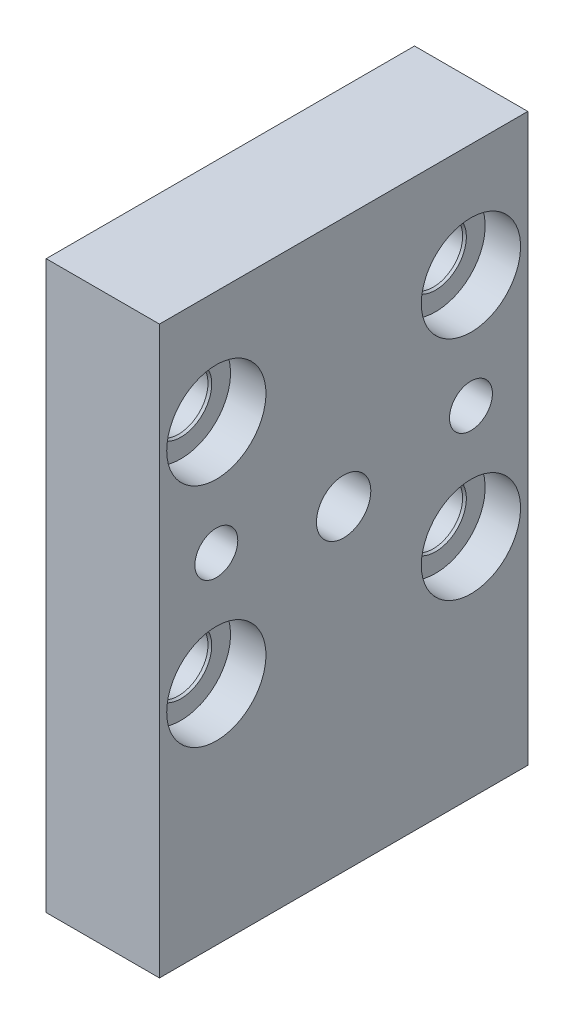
from build123d import *

# Parameters (mm, degrees)
SKETCH1_W          = 20.6502
SKETCH1_H          = 31.75
SKETCH1_R          = 1.20269
SKETCH1_R_2        = 1.524
EXTRUDE1_DEPTH     = 6.35
SKETCH6_R          = 2.7432
CUT_EXTRUDE1_DEPTH = 3.175
SKETCH7_R          = 2.7432
CUT_EXTRUDE2_DEPTH = 3.175
SKETCH8_R          = 2.7432
CUT_EXTRUDE3_DEPTH = 3.175
CUT_EXTRUDE4_DEPTH = 1.5875
CUT_EXTRUDE5_DEPTH = 1.5875
CUT_EXTRUDE6_DEPTH = 1.5875


with BuildPart() as part:
    # Sketch1 → Extrude1 (new body)
    with BuildSketch(Plane(origin=(0, 0, 0), x_dir=(0, 0, -1), z_dir=(1, 0, 0))):
        with Locations((0, 15.875)):
            Rectangle(SKETCH1_W, SKETCH1_H)
        with Locations((7.1374, 19.05)):
            Circle(SKETCH1_R, mode=Mode.SUBTRACT)
        with Locations((0, 17.7292)):
            Circle(SKETCH1_R_2, mode=Mode.SUBTRACT)
        with Locations((-7.1374, 19.05)):
            Circle(SKETCH1_R, mode=Mode.SUBTRACT)
    extrude(amount=EXTRUDE1_DEPTH)

    # Sketch2 → Cut-Revolve1 (revolve, cut)
    with BuildSketch(Plane.XY.offset(7.1374), mode=Mode.PRIVATE) as cut_revolve1_sk:
        Polygon((0, 25.4), (0, 27.051), (4.233333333, 27.051), (4.365315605, 27.1272), (4.365315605, 28.1813), (6.35, 28.1813), (6.35, 25.4), align=None)
    revolve(cut_revolve1_sk.sketch.rotate(Axis((6.35, 25.4, 7.1374), (-1, 0, 0)), 270), axis=Axis((6.35, 25.4, 7.1374), (-1, 0, 0)), mode=Mode.SUBTRACT)

    # Sketch3 → Cut-Revolve2 (revolve, cut)
    with BuildSketch(Plane.XY.offset(-7.1374), mode=Mode.PRIVATE) as cut_revolve2_sk:
        Polygon((0, 12.7), (0, 14.351), (4.233333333, 14.351), (4.365315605, 14.4272), (4.365315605, 15.4813), (6.35, 15.4813), (6.35, 12.7), align=None)
    revolve(cut_revolve2_sk.sketch.rotate(Axis((6.35, 12.7, -7.1374), (-1, 0, 0)), 270), axis=Axis((6.35, 12.7, -7.1374), (-1, 0, 0)), mode=Mode.SUBTRACT)

    # Sketch4 → Cut-Revolve3 (revolve, cut)
    with BuildSketch(Plane.XY.offset(7.1374), mode=Mode.PRIVATE) as cut_revolve3_sk:
        Polygon((0, 12.7), (0, 14.351), (4.233333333, 14.351), (4.365315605, 14.4272), (4.365315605, 15.4813), (6.35, 15.4813), (6.35, 12.7), align=None)
    revolve(cut_revolve3_sk.sketch.rotate(Axis((6.35, 12.7, 7.1374), (-1, 0, 0)), 270), axis=Axis((6.35, 12.7, 7.1374), (-1, 0, 0)), mode=Mode.SUBTRACT)

    # Sketch5 → Cut-Revolve4 (revolve, cut)
    with BuildSketch(Plane.XY.offset(-7.1374), mode=Mode.PRIVATE) as cut_revolve4_sk:
        Polygon((0, 25.4), (0, 27.051), (4.233333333, 27.051), (4.365315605, 27.1272), (4.365315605, 28.1813), (6.35, 28.1813), (6.35, 25.4), align=None)
    revolve(cut_revolve4_sk.sketch.rotate(Axis((6.35, 25.4, -7.1374), (-1, 0, 0)), 270), axis=Axis((6.35, 25.4, -7.1374), (-1, 0, 0)), mode=Mode.SUBTRACT)

    # Sketch6 → Cut-Extrude1 (cut)
    with BuildSketch(Plane(origin=(0, 0, 0), x_dir=(0, 0, -1), z_dir=(1, 0, 0))):
        with Locations((0, 7.5692)):
            Circle(SKETCH6_R)
    extrude(amount=CUT_EXTRUDE1_DEPTH, mode=Mode.SUBTRACT)

    # Sketch7 → Cut-Extrude2 (cut)
    with BuildSketch(Plane(origin=(0, 0, 0), x_dir=(0, 0, -1), z_dir=(1, 0, 0))):
        with Locations((0, 22.8346)):
            Circle(SKETCH7_R)
    extrude(amount=CUT_EXTRUDE2_DEPTH, mode=Mode.SUBTRACT)

    # Sketch8 → Cut-Extrude3 (cut)
    with BuildSketch(Plane(origin=(0, 0, 0), x_dir=(0, 0, -1), z_dir=(1, 0, 0))):
        with Locations((0, 28.4226)):
            Circle(SKETCH8_R)
    extrude(amount=CUT_EXTRUDE3_DEPTH, mode=Mode.SUBTRACT)

    # Sketch9 → Revolve1 (revolve)
    with BuildSketch(Plane.XY, mode=Mode.PRIVATE) as revolve1_sk:
        with BuildLine():
            Line((0, 7.5692), (0, 9.6012))
            ThreePointArc((0, 9.6012), (0.148789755, 9.960410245), (0.508, 10.1092))
            Line((0.508, 10.1092), (3.175, 10.1092))
            Line((3.175, 10.1092), (3.175, 7.5692))
            Line((3.175, 7.5692), (0, 7.5692))
        make_face()
    revolve(revolve1_sk.sketch.rotate(Axis((3.175, 7.5692, 0), (-1, 0, 0)), 270), axis=Axis((3.175, 7.5692, 0), (-1, 0, 0)))

    # Sketch10 → Revolve2 (revolve)
    with BuildSketch(Plane.XY, mode=Mode.PRIVATE) as revolve2_sk:
        with BuildLine():
            Line((0, 28.4226), (0, 30.4546))
            ThreePointArc((0, 30.4546), (0.148789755, 30.813810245), (0.508, 30.9626))
            Line((0.508, 30.9626), (3.175, 30.9626))
            Line((3.175, 30.9626), (3.175, 28.4226))
            Line((3.175, 28.4226), (0, 28.4226))
        make_face()
    revolve(revolve2_sk.sketch.rotate(Axis((3.175, 28.4226, 0), (-1, 0, 0)), 270), axis=Axis((3.175, 28.4226, 0), (-1, 0, 0)))

    # Sketch11 → Revolve3 (revolve)
    with BuildSketch(Plane.XY, mode=Mode.PRIVATE) as revolve3_sk:
        with BuildLine():
            Line((0, 22.8346), (0, 24.8666))
            ThreePointArc((0, 24.8666), (0.148789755, 25.225810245), (0.508, 25.3746))
            Line((0.508, 25.3746), (3.175, 25.3746))
            Line((3.175, 25.3746), (3.175, 22.8346))
            Line((3.175, 22.8346), (0, 22.8346))
        make_face()
    revolve(revolve3_sk.sketch.rotate(Axis((3.175, 22.8346, 0), (-1, 0, 0)), 270), axis=Axis((3.175, 22.8346, 0), (-1, 0, 0)))

    # Sketch12 → Cut-Extrude4 (cut)
    with BuildSketch(Plane(origin=(0, 0, 0), x_dir=(0, 0, -1), z_dir=(1, 0, 0))):
        Polygon((-1.5875, 8.485743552), (-1.5875, 6.652656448), (0, 5.736112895), (1.5875, 6.652656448), (1.5875, 8.485743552), (0, 9.402287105), align=None)
    extrude(amount=CUT_EXTRUDE4_DEPTH, mode=Mode.SUBTRACT)

    # Sketch13 → Cut-Extrude5 (cut)
    with BuildSketch(Plane(origin=(0, 0, 0), x_dir=(0, 0, -1), z_dir=(1, 0, 0))):
        Polygon((-1.5875, 29.339143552), (-1.5875, 27.506056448), (0, 26.589512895), (1.5875, 27.506056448), (1.5875, 29.339143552), (0, 30.255687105), align=None)
    extrude(amount=CUT_EXTRUDE5_DEPTH, mode=Mode.SUBTRACT)

    # Sketch14 → Cut-Extrude6 (cut)
    with BuildSketch(Plane(origin=(0, 0, 0), x_dir=(0, 0, -1), z_dir=(1, 0, 0))):
        Polygon((-1.5875, 23.751143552), (-1.5875, 21.918056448), (0, 21.001512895), (1.5875, 21.918056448), (1.5875, 23.751143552), (0, 24.667687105), align=None)
    extrude(amount=CUT_EXTRUDE6_DEPTH, mode=Mode.SUBTRACT)


solid = part.part
